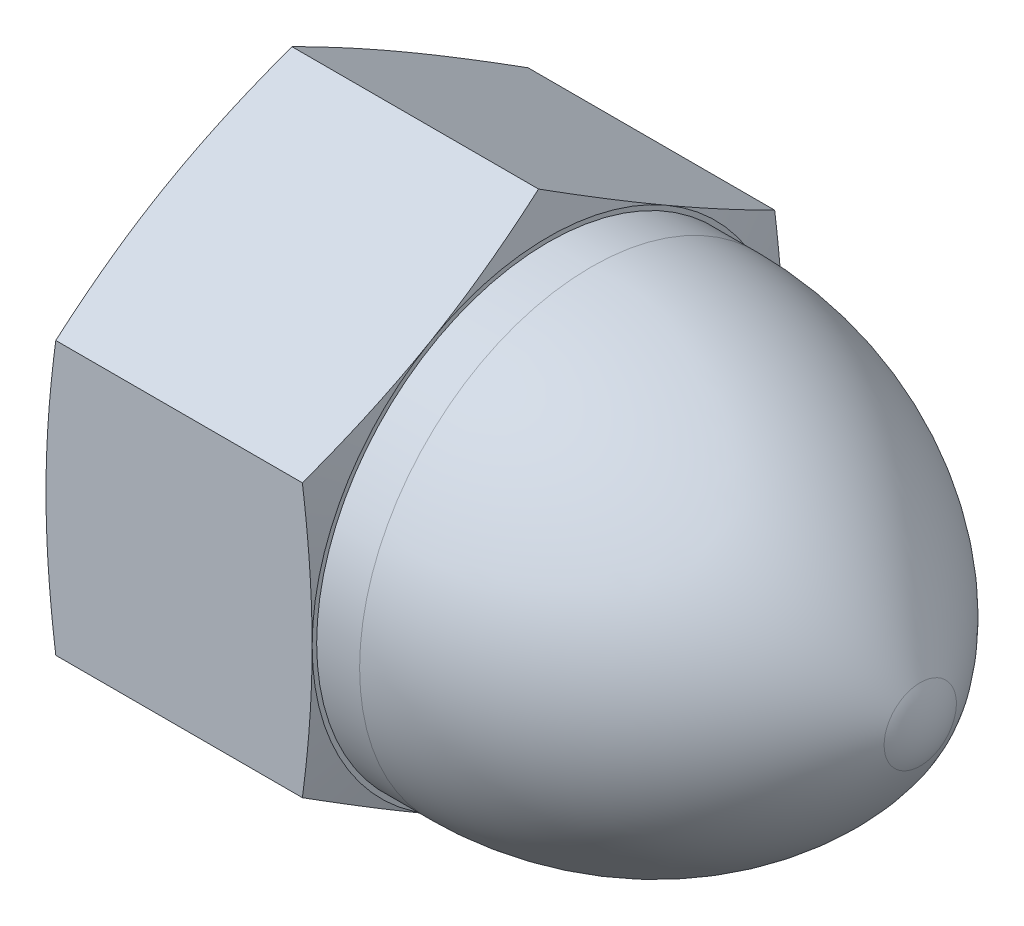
from build123d import *

# Parameters (mm, degrees)
BASENUT_DEPTH = 20.574


with BuildPart() as part:
    # BaseNutSke → BaseNut (new body)
    with BuildSketch(Plane(origin=(0, 0, 0), x_dir=(0, 0, -1), z_dir=(1, 0, 0))):
        Polygon((18.25625, 10.540250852), (18.25625, -10.540250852), (0, -21.080501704), (-18.25625, -10.540250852), (-18.25625, 10.540250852), (0, 21.080501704), align=None)
    extrude(amount=BASENUT_DEPTH)

    # Sketch3 → Crown (revolve)
    with BuildSketch(Plane.XY, mode=Mode.PRIVATE) as crown_sk:
        with BuildLine():
            Line((50.038, 0), (0, 0))
            Line((0, 0), (0, 17.907))
            Line((0, 17.907), (23.89386723, 17.907))
            ThreePointArc((23.89386723, 17.907), (38.686643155, 13.843242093), (49.327308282, 2.792604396))
            ThreePointArc((49.327308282, 2.792604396), (49.857539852, 1.440808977), (50.038, 0))
        make_face()
    revolve(crown_sk.sketch.rotate(Axis((0, 0, 0), (1, 0, 0)), 90), axis=Axis((0, 0, 0), (1, 0, 0)))

    # Sketch4 → DoubleChamfer (revolve, cut)
    with BuildSketch(Plane.XY, mode=Mode.PRIVATE) as doublechamfer_sk:
        Polygon((0, 18.25625), (1.949893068, 25.53335), (18.624460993, 25.53335), (20.574, 18.25625), (33.274, 18.25625), (33.274, 43.65625), (-12.7, 43.65625), (-12.7, 18.25625), align=None)
    revolve(doublechamfer_sk.sketch.rotate(Axis((0, 0, 0), (1, 0, 0)), 90), axis=Axis((0, 0, 0), (1, 0, 0)), mode=Mode.SUBTRACT)

    # Sketch5 → TapDrill (revolve, cut)
    with BuildSketch(Plane.XY, mode=Mode.PRIVATE) as tapdrill_sk:
        Polygon((0, 11.1125), (35.052, 11.1125), (41.729063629, 0), (0, 0), align=None)
    revolve(tapdrill_sk.sketch.rotate(Axis((0, 0, 0), (1, 0, 0)), 90), axis=Axis((0, 0, 0), (1, 0, 0)), mode=Mode.SUBTRACT)

    # EndChamferSketch → EndChamfer (revolve, cut)
    with BuildSketch(Plane.XY, mode=Mode.PRIVATE) as endchamfer_sk:
        Polygon((-0.0254, 12.7), (0.0254, 12.7), (1.248137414, 10.95375), (-0.0254, 10.95375), align=None)
    revolve(endchamfer_sk.sketch.rotate(Axis((-3.175, 0, 0), (-1, 0, 0)), 270), axis=Axis((-3.175, 0, 0), (-1, 0, 0)), mode=Mode.SUBTRACT)


solid = part.part
